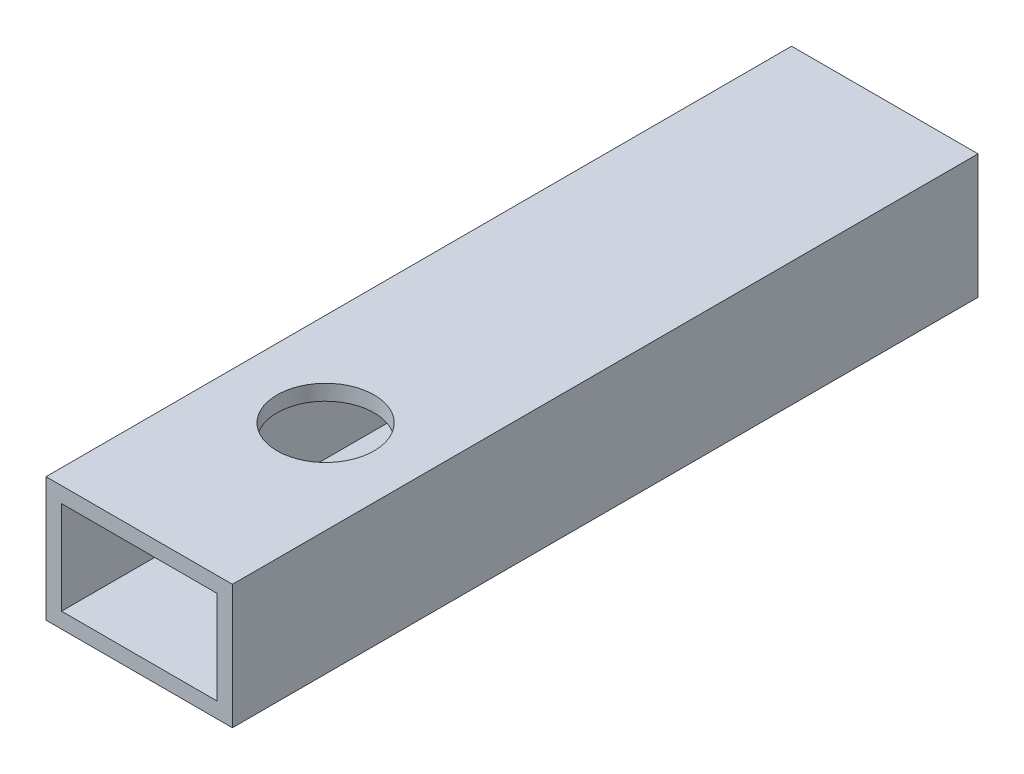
from build123d import *

# Parameters (mm, degrees)
SKETCH1_W          = 76.2
SKETCH1_H          = 50.8
SKETCH1_W_2        = 63.5
SKETCH1_H_2        = 38.1
EXTRUDE1_DEPTH     = 304.8
SKETCH2_R          = 19.8374
CUT_EXTRUDE1_DEPTH = 12.7


with BuildPart() as part:
    # Sketch1 → Extrude1 (new body)
    with BuildSketch(Plane.XY):
        Rectangle(SKETCH1_W, SKETCH1_H)
        Rectangle(SKETCH1_W_2, SKETCH1_H_2, mode=Mode.SUBTRACT)
    extrude(amount=-EXTRUDE1_DEPTH)

    # Sketch2 → Cut-Extrude1 (cut)
    with BuildSketch(Plane(origin=(0, 25.4, 0), x_dir=(-1, 0, 0), z_dir=(0, 1, 0))):
        with Locations(Location((0, -76.2, 0), (0, 0, 90))):
            Circle(SKETCH2_R)
    extrude(amount=-CUT_EXTRUDE1_DEPTH, mode=Mode.SUBTRACT)


solid = part.part
